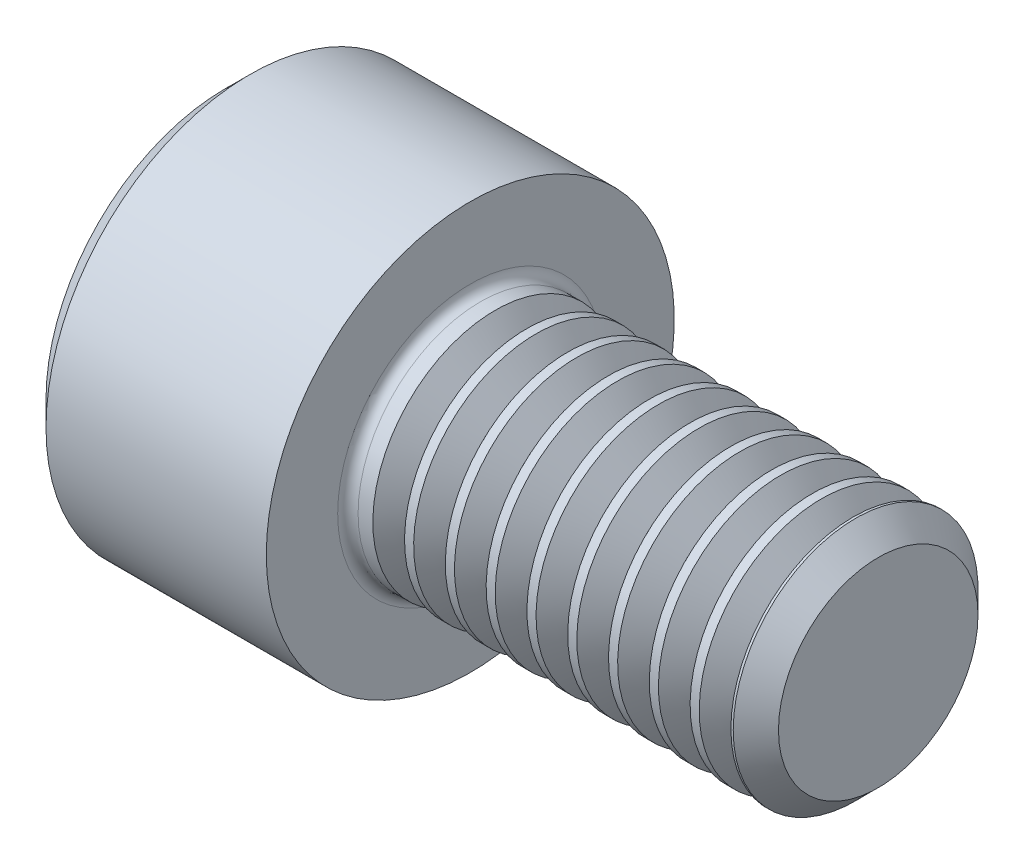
ISO-10303-21;
HEADER;
FILE_DESCRIPTION(('STEP AP214'),'2;1');
FILE_NAME('part.step','',(''),(''),'','','');
FILE_SCHEMA(('AUTOMOTIVE_DESIGN { 1 0 10303 214 1 1 1 1 }'));
ENDSEC;
DATA;
#1=APPLICATION_CONTEXT('core data for automotive mechanical design processes');
#2=APPLICATION_PROTOCOL_DEFINITION('international standard','automotive_design',2000,#1);
#3=PRODUCT_CONTEXT('',#1,'mechanical');
#4=PRODUCT('Part','Part','',(#3));
#5=PRODUCT_RELATED_PRODUCT_CATEGORY('part','',(#4));
#6=PRODUCT_DEFINITION_FORMATION('','',#4);
#7=PRODUCT_DEFINITION_CONTEXT('part definition',#1,'design');
#8=PRODUCT_DEFINITION('design','',#6,#7);
#9=PRODUCT_DEFINITION_SHAPE('','',#8);
#10=(LENGTH_UNIT() NAMED_UNIT(*) SI_UNIT(.MILLI.,.METRE.));
#11=(NAMED_UNIT(*) PLANE_ANGLE_UNIT() SI_UNIT($,.RADIAN.));
#12=(NAMED_UNIT(*) SI_UNIT($,.STERADIAN.) SOLID_ANGLE_UNIT());
#13=UNCERTAINTY_MEASURE_WITH_UNIT(LENGTH_MEASURE(1.E-05),#10,'distance_accuracy_value','');
#14=(GEOMETRIC_REPRESENTATION_CONTEXT(3) GLOBAL_UNCERTAINTY_ASSIGNED_CONTEXT((#13)) GLOBAL_UNIT_ASSIGNED_CONTEXT((#10,
#11,#12)) REPRESENTATION_CONTEXT('',''));
#15=CARTESIAN_POINT('',(0.,0.,0.));
#16=DIRECTION('',(0.,0.,1.));
#17=DIRECTION('',(1.,0.,0.));
#18=AXIS2_PLACEMENT_3D('',#15,#16,#17);
#19=CARTESIAN_POINT('',(0.,0.,0.));
#20=DIRECTION('',(-1.,0.,0.));
#21=DIRECTION('',(0.,0.,1.));
#22=AXIS2_PLACEMENT_3D('',#19,#20,#21);
#23=PLANE('',#22);
#24=DIRECTION('',(0.,-0.499999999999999,0.866025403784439));
#25=VECTOR('',#24,1.);
#26=CARTESIAN_POINT('',(0.,2.93524876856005,0.));
#27=LINE('',#26,#25);
#28=CARTESIAN_POINT('',(0.,2.93524876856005,0.));
#29=VERTEX_POINT('',#28);
#30=CARTESIAN_POINT('',(0.,1.46762438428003,2.542));
#31=VERTEX_POINT('',#30);
#32=EDGE_CURVE('E711',#29,#31,#27,.T.);
#33=ORIENTED_EDGE('',*,*,#32,.T.);
#34=DIRECTION('',(0.,1.,0.));
#35=VECTOR('',#34,1.);
#36=CARTESIAN_POINT('',(0.,-1.46762438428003,2.542));
#37=LINE('',#36,#35);
#38=CARTESIAN_POINT('',(0.,-1.46762438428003,2.542));
#39=VERTEX_POINT('',#38);
#40=EDGE_CURVE('E131',#39,#31,#37,.T.);
#41=ORIENTED_EDGE('',*,*,#40,.F.);
#42=DIRECTION('',(0.,-0.500000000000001,-0.866025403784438));
#43=VECTOR('',#42,1.);
#44=CARTESIAN_POINT('',(0.,-1.46762438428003,2.542));
#45=LINE('',#44,#43);
#46=CARTESIAN_POINT('',(0.,-2.93524876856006,0.));
#47=VERTEX_POINT('',#46);
#48=EDGE_CURVE('E730',#39,#47,#45,.T.);
#49=ORIENTED_EDGE('',*,*,#48,.T.);
#50=DIRECTION('',(0.,0.499999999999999,-0.866025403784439));
#51=VECTOR('',#50,1.);
#52=CARTESIAN_POINT('',(0.,-2.93524876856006,0.));
#53=LINE('',#52,#51);
#54=CARTESIAN_POINT('',(0.,-1.46762438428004,-2.542));
#55=VERTEX_POINT('',#54);
#56=EDGE_CURVE('E733',#47,#55,#53,.T.);
#57=ORIENTED_EDGE('',*,*,#56,.T.);
#58=DIRECTION('',(0.,-1.,0.));
#59=VECTOR('',#58,1.);
#60=CARTESIAN_POINT('',(0.,1.46762438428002,-2.542));
#61=LINE('',#60,#59);
#62=CARTESIAN_POINT('',(0.,1.46762438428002,-2.542));
#63=VERTEX_POINT('',#62);
#64=EDGE_CURVE('E736',#63,#55,#61,.T.);
#65=ORIENTED_EDGE('',*,*,#64,.F.);
#66=DIRECTION('',(0.,-0.500000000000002,-0.866025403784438));
#67=VECTOR('',#66,1.);
#68=CARTESIAN_POINT('',(0.,2.93524876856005,0.));
#69=LINE('',#68,#67);
#70=EDGE_CURVE('E126',#29,#63,#69,.T.);
#71=ORIENTED_EDGE('',*,*,#70,.F.);
#72=EDGE_LOOP('',(#33,#41,#49,#57,#65,#71));
#73=FACE_BOUND('',#72,.T.);
#74=CARTESIAN_POINT('',(0.,0.,0.));
#75=DIRECTION('',(-1.,0.,0.));
#76=DIRECTION('',(0.,0.,1.));
#77=AXIS2_PLACEMENT_3D('',#74,#75,#76);
#78=CIRCLE('',#77,4.4);
#79=CARTESIAN_POINT('',(0.,0.,4.4));
#80=VERTEX_POINT('',#79);
#81=EDGE_CURVE('E142',#80,#80,#78,.T.);
#82=ORIENTED_EDGE('',*,*,#81,.T.);
#83=EDGE_LOOP('',(#82));
#84=FACE_BOUND('',#83,.T.);
#85=ADVANCED_FACE('F35',(#73,#84),#23,.T.);
#86=CARTESIAN_POINT('',(-31.75,0.,0.));
#87=DIRECTION('',(-1.,0.,0.));
#88=DIRECTION('',(0.,0.,1.));
#89=AXIS2_PLACEMENT_3D('',#86,#87,#88);
#90=CYLINDRICAL_SURFACE('',#89,3.);
#91=CARTESIAN_POINT('',(6.61173492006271,0.,0.));
#92=DIRECTION('',(-1.,0.,0.));
#93=DIRECTION('',(0.,-1.,0.));
#94=AXIS2_PLACEMENT_3D('',#91,#92,#93);
#95=CIRCLE('',#94,3.);
#96=CARTESIAN_POINT('',(6.61173492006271,-3.,0.));
#97=VERTEX_POINT('',#96);
#98=EDGE_CURVE('E706',#97,#97,#95,.T.);
#99=ORIENTED_EDGE('',*,*,#98,.T.);
#100=EDGE_LOOP('',(#99));
#101=FACE_BOUND('',#100,.T.);
#102=CARTESIAN_POINT('',(6.25,0.,0.));
#103=DIRECTION('',(1.,0.,0.));
#104=DIRECTION('',(0.,0.,-1.));
#105=AXIS2_PLACEMENT_3D('',#102,#103,#104);
#106=CIRCLE('',#105,3.);
#107=CARTESIAN_POINT('',(6.25,0.,-3.));
#108=VERTEX_POINT('',#107);
#109=EDGE_CURVE('E11',#108,#108,#106,.T.);
#110=ORIENTED_EDGE('',*,*,#109,.T.);
#111=EDGE_LOOP('',(#110));
#112=FACE_BOUND('',#111,.T.);
#113=ADVANCED_FACE('F176',(#101,#112),#90,.T.);
#114=CARTESIAN_POINT('',(6.,5.,0.));
#115=DIRECTION('',(1.,0.,0.));
#116=DIRECTION('',(0.,0.,-1.));
#117=AXIS2_PLACEMENT_3D('',#114,#115,#116);
#118=PLANE('',#117);
#119=CARTESIAN_POINT('',(6.,0.,0.));
#120=DIRECTION('',(1.,0.,0.));
#121=DIRECTION('',(0.,0.,-1.));
#122=AXIS2_PLACEMENT_3D('',#119,#120,#121);
#123=CIRCLE('',#122,3.25);
#124=CARTESIAN_POINT('',(6.,0.,-3.25));
#125=VERTEX_POINT('',#124);
#126=EDGE_CURVE('E43',#125,#125,#123,.F.);
#127=ORIENTED_EDGE('',*,*,#126,.T.);
#128=EDGE_LOOP('',(#127));
#129=FACE_BOUND('',#128,.T.);
#130=CARTESIAN_POINT('',(6.00000000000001,0.,0.));
#131=DIRECTION('',(-1.,0.,0.));
#132=DIRECTION('',(0.,0.,1.));
#133=AXIS2_PLACEMENT_3D('',#130,#131,#132);
#134=CIRCLE('',#133,5.);
#135=CARTESIAN_POINT('',(6.00000000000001,0.,5.));
#136=VERTEX_POINT('',#135);
#137=EDGE_CURVE('E149',#136,#136,#134,.T.);
#138=ORIENTED_EDGE('',*,*,#137,.F.);
#139=EDGE_LOOP('',(#138));
#140=FACE_BOUND('',#139,.T.);
#141=ADVANCED_FACE('F160',(#129,#140),#118,.T.);
#142=CARTESIAN_POINT('',(-31.75,0.,0.));
#143=DIRECTION('',(-1.,0.,0.));
#144=DIRECTION('',(0.,0.,1.));
#145=AXIS2_PLACEMENT_3D('',#142,#143,#144);
#146=CYLINDRICAL_SURFACE('',#145,5.);
#147=ORIENTED_EDGE('',*,*,#137,.T.);
#148=EDGE_LOOP('',(#147));
#149=FACE_BOUND('',#148,.T.);
#150=CARTESIAN_POINT('',(0.600000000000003,0.,0.));
#151=DIRECTION('',(-1.,0.,0.));
#152=DIRECTION('',(0.,0.,1.));
#153=AXIS2_PLACEMENT_3D('',#150,#151,#152);
#154=CIRCLE('',#153,5.);
#155=CARTESIAN_POINT('',(0.600000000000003,0.,5.));
#156=VERTEX_POINT('',#155);
#157=EDGE_CURVE('E146',#156,#156,#154,.T.);
#158=ORIENTED_EDGE('',*,*,#157,.F.);
#159=EDGE_LOOP('',(#158));
#160=FACE_BOUND('',#159,.T.);
#161=ADVANCED_FACE('F171',(#149,#160),#146,.T.);
#162=CARTESIAN_POINT('',(0.,0.,0.));
#163=DIRECTION('',(1.,0.,0.));
#164=DIRECTION('',(0.,0.,-1.));
#165=AXIS2_PLACEMENT_3D('',#162,#163,#164);
#166=CONICAL_SURFACE('',#165,4.4,0.785398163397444);
#167=ORIENTED_EDGE('',*,*,#157,.T.);
#168=EDGE_LOOP('',(#167));
#169=FACE_BOUND('',#168,.T.);
#170=ORIENTED_EDGE('',*,*,#81,.F.);
#171=EDGE_LOOP('',(#170));
#172=FACE_BOUND('',#171,.T.);
#173=ADVANCED_FACE('F164',(#169,#172),#166,.T.);
#174=CARTESIAN_POINT('',(6.25,0.,0.));
#175=DIRECTION('',(1.,0.,0.));
#176=DIRECTION('',(0.,0.,-1.));
#177=AXIS2_PLACEMENT_3D('',#174,#175,#176);
#178=TOROIDAL_SURFACE('',#177,3.25,0.25);
#179=ORIENTED_EDGE('',*,*,#109,.F.);
#180=EDGE_LOOP('',(#179));
#181=FACE_BOUND('',#180,.T.);
#182=ORIENTED_EDGE('',*,*,#126,.F.);
#183=EDGE_LOOP('',(#182));
#184=FACE_BOUND('',#183,.T.);
#185=ADVANCED_FACE('F37',(#181,#184),#178,.F.);
#186=CARTESIAN_POINT('',(3.,2.93524876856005,0.));
#187=DIRECTION('',(0.,-0.866025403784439,-0.499999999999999));
#188=DIRECTION('',(0.,0.499999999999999,-0.866025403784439));
#189=AXIS2_PLACEMENT_3D('',#186,#187,#188);
#190=PLANE('',#189);
#191=ORIENTED_EDGE('',*,*,#32,.F.);
#192=DIRECTION('',(-1.,0.,0.));
#193=VECTOR('',#192,1.);
#194=CARTESIAN_POINT('',(3.,2.93524876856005,0.));
#195=LINE('',#194,#193);
#196=CARTESIAN_POINT('',(3.,2.93524876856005,0.));
#197=VERTEX_POINT('',#196);
#198=EDGE_CURVE('E727',#197,#29,#195,.T.);
#199=ORIENTED_EDGE('',*,*,#198,.F.);
#200=DIRECTION('',(0.,-0.499999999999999,0.866025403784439));
#201=VECTOR('',#200,1.);
#202=CARTESIAN_POINT('',(3.,2.93524876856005,0.));
#203=LINE('',#202,#201);
#204=CARTESIAN_POINT('',(3.,2.20143657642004,1.271));
#205=VERTEX_POINT('',#204);
#206=EDGE_CURVE('E118',#197,#205,#203,.T.);
#207=ORIENTED_EDGE('',*,*,#206,.T.);
#208=CARTESIAN_POINT('',(3.,1.46762438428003,2.542));
#209=VERTEX_POINT('',#208);
#210=EDGE_CURVE('E109',#205,#209,#203,.T.);
#211=ORIENTED_EDGE('',*,*,#210,.T.);
#212=DIRECTION('',(-1.,0.,0.));
#213=VECTOR('',#212,1.);
#214=CARTESIAN_POINT('',(3.,1.46762438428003,2.542));
#215=LINE('',#214,#213);
#216=EDGE_CURVE('E123',#209,#31,#215,.T.);
#217=ORIENTED_EDGE('',*,*,#216,.T.);
#218=EDGE_LOOP('',(#191,#199,#207,#211,#217));
#219=FACE_BOUND('',#218,.T.);
#220=ADVANCED_FACE('F122',(#219),#190,.T.);
#221=CARTESIAN_POINT('',(3.,-1.46762438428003,2.542));
#222=DIRECTION('',(0.,0.,1.));
#223=DIRECTION('',(0.,-1.,0.));
#224=AXIS2_PLACEMENT_3D('',#221,#222,#223);
#225=PLANE('',#224);
#226=ORIENTED_EDGE('',*,*,#40,.T.);
#227=ORIENTED_EDGE('',*,*,#216,.F.);
#228=DIRECTION('',(0.,1.,0.));
#229=VECTOR('',#228,1.);
#230=CARTESIAN_POINT('',(3.,-1.46762438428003,2.542));
#231=LINE('',#230,#229);
#232=CARTESIAN_POINT('',(3.,0.,2.542));
#233=VERTEX_POINT('',#232);
#234=EDGE_CURVE('E106',#233,#209,#231,.T.);
#235=ORIENTED_EDGE('',*,*,#234,.F.);
#236=CARTESIAN_POINT('',(3.,-1.46762438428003,2.542));
#237=VERTEX_POINT('',#236);
#238=EDGE_CURVE('E117',#237,#233,#231,.T.);
#239=ORIENTED_EDGE('',*,*,#238,.F.);
#240=DIRECTION('',(-1.,0.,0.));
#241=VECTOR('',#240,1.);
#242=CARTESIAN_POINT('',(3.,-1.46762438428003,2.542));
#243=LINE('',#242,#241);
#244=EDGE_CURVE('E133',#237,#39,#243,.T.);
#245=ORIENTED_EDGE('',*,*,#244,.T.);
#246=EDGE_LOOP('',(#226,#227,#235,#239,#245));
#247=FACE_BOUND('',#246,.T.);
#248=ADVANCED_FACE('F128',(#247),#225,.F.);
#249=CARTESIAN_POINT('',(3.,-1.46762438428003,2.542));
#250=DIRECTION('',(0.,0.866025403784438,-0.500000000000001));
#251=DIRECTION('',(0.,0.500000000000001,0.866025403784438));
#252=AXIS2_PLACEMENT_3D('',#249,#250,#251);
#253=PLANE('',#252);
#254=ORIENTED_EDGE('',*,*,#48,.F.);
#255=ORIENTED_EDGE('',*,*,#244,.F.);
#256=DIRECTION('',(0.,-0.500000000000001,-0.866025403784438));
#257=VECTOR('',#256,1.);
#258=CARTESIAN_POINT('',(3.,-1.46762438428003,2.542));
#259=LINE('',#258,#257);
#260=CARTESIAN_POINT('',(3.,-2.20143657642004,1.271));
#261=VERTEX_POINT('',#260);
#262=EDGE_CURVE('E714',#237,#261,#259,.T.);
#263=ORIENTED_EDGE('',*,*,#262,.T.);
#264=CARTESIAN_POINT('',(3.,-2.93524876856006,0.));
#265=VERTEX_POINT('',#264);
#266=EDGE_CURVE('E713',#261,#265,#259,.T.);
#267=ORIENTED_EDGE('',*,*,#266,.T.);
#268=DIRECTION('',(-1.,0.,0.));
#269=VECTOR('',#268,1.);
#270=CARTESIAN_POINT('',(3.,-2.93524876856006,0.));
#271=LINE('',#270,#269);
#272=EDGE_CURVE('E138',#265,#47,#271,.T.);
#273=ORIENTED_EDGE('',*,*,#272,.T.);
#274=EDGE_LOOP('',(#254,#255,#263,#267,#273));
#275=FACE_BOUND('',#274,.T.);
#276=ADVANCED_FACE('F306',(#275),#253,.T.);
#277=CARTESIAN_POINT('',(3.,-2.93524876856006,0.));
#278=DIRECTION('',(0.,0.866025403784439,0.499999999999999));
#279=DIRECTION('',(0.,-0.499999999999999,0.866025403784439));
#280=AXIS2_PLACEMENT_3D('',#277,#278,#279);
#281=PLANE('',#280);
#282=ORIENTED_EDGE('',*,*,#56,.F.);
#283=ORIENTED_EDGE('',*,*,#272,.F.);
#284=DIRECTION('',(0.,0.499999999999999,-0.866025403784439));
#285=VECTOR('',#284,1.);
#286=CARTESIAN_POINT('',(3.,-2.93524876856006,0.));
#287=LINE('',#286,#285);
#288=CARTESIAN_POINT('',(3.,-2.20143657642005,-1.271));
#289=VERTEX_POINT('',#288);
#290=EDGE_CURVE('E718',#265,#289,#287,.T.);
#291=ORIENTED_EDGE('',*,*,#290,.T.);
#292=CARTESIAN_POINT('',(3.,-1.46762438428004,-2.542));
#293=VERTEX_POINT('',#292);
#294=EDGE_CURVE('E717',#289,#293,#287,.T.);
#295=ORIENTED_EDGE('',*,*,#294,.T.);
#296=DIRECTION('',(-1.,0.,0.));
#297=VECTOR('',#296,1.);
#298=CARTESIAN_POINT('',(3.,-1.46762438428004,-2.542));
#299=LINE('',#298,#297);
#300=EDGE_CURVE('E745',#293,#55,#299,.T.);
#301=ORIENTED_EDGE('',*,*,#300,.T.);
#302=EDGE_LOOP('',(#282,#283,#291,#295,#301));
#303=FACE_BOUND('',#302,.T.);
#304=ADVANCED_FACE('F302',(#303),#281,.T.);
#305=CARTESIAN_POINT('',(3.,1.46762438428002,-2.542));
#306=DIRECTION('',(0.,0.,-1.));
#307=DIRECTION('',(0.,1.,0.));
#308=AXIS2_PLACEMENT_3D('',#305,#306,#307);
#309=PLANE('',#308);
#310=ORIENTED_EDGE('',*,*,#64,.T.);
#311=ORIENTED_EDGE('',*,*,#300,.F.);
#312=DIRECTION('',(0.,-1.,0.));
#313=VECTOR('',#312,1.);
#314=CARTESIAN_POINT('',(3.,1.46762438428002,-2.542));
#315=LINE('',#314,#313);
#316=CARTESIAN_POINT('',(3.00000000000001,0.,-2.542));
#317=VERTEX_POINT('',#316);
#318=EDGE_CURVE('E721',#317,#293,#315,.T.);
#319=ORIENTED_EDGE('',*,*,#318,.F.);
#320=CARTESIAN_POINT('',(3.,1.46762438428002,-2.542));
#321=VERTEX_POINT('',#320);
#322=EDGE_CURVE('E50',#321,#317,#315,.T.);
#323=ORIENTED_EDGE('',*,*,#322,.F.);
#324=DIRECTION('',(-1.,0.,0.));
#325=VECTOR('',#324,1.);
#326=CARTESIAN_POINT('',(3.,1.46762438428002,-2.542));
#327=LINE('',#326,#325);
#328=EDGE_CURVE('E742',#321,#63,#327,.T.);
#329=ORIENTED_EDGE('',*,*,#328,.T.);
#330=EDGE_LOOP('',(#310,#311,#319,#323,#329));
#331=FACE_BOUND('',#330,.T.);
#332=ADVANCED_FACE('F298',(#331),#309,.F.);
#333=CARTESIAN_POINT('',(3.,2.93524876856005,0.));
#334=DIRECTION('',(0.,0.866025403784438,-0.500000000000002));
#335=DIRECTION('',(0.,0.500000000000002,0.866025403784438));
#336=AXIS2_PLACEMENT_3D('',#333,#334,#335);
#337=PLANE('',#336);
#338=ORIENTED_EDGE('',*,*,#70,.T.);
#339=ORIENTED_EDGE('',*,*,#328,.F.);
#340=DIRECTION('',(0.,-0.500000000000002,-0.866025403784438));
#341=VECTOR('',#340,1.);
#342=CARTESIAN_POINT('',(3.,2.93524876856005,0.));
#343=LINE('',#342,#341);
#344=CARTESIAN_POINT('',(3.,2.20143657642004,-1.271));
#345=VERTEX_POINT('',#344);
#346=EDGE_CURVE('E723',#345,#321,#343,.T.);
#347=ORIENTED_EDGE('',*,*,#346,.F.);
#348=EDGE_CURVE('E724',#197,#345,#343,.T.);
#349=ORIENTED_EDGE('',*,*,#348,.F.);
#350=ORIENTED_EDGE('',*,*,#198,.T.);
#351=EDGE_LOOP('',(#338,#339,#347,#349,#350));
#352=FACE_BOUND('',#351,.T.);
#353=ADVANCED_FACE('F293',(#352),#337,.F.);
#354=CARTESIAN_POINT('',(3.,2.93524876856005,0.));
#355=DIRECTION('',(1.,0.,0.));
#356=DIRECTION('',(0.,0.,-1.));
#357=AXIS2_PLACEMENT_3D('',#354,#355,#356);
#358=PLANE('',#357);
#359=ORIENTED_EDGE('',*,*,#318,.T.);
#360=ORIENTED_EDGE('',*,*,#294,.F.);
#361=CARTESIAN_POINT('',(3.00000000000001,0.,0.));
#362=DIRECTION('',(-1.,0.,0.));
#363=DIRECTION('',(0.,0.,1.));
#364=AXIS2_PLACEMENT_3D('',#361,#362,#363);
#365=CIRCLE('',#364,2.542);
#366=EDGE_CURVE('E760',#317,#289,#365,.T.);
#367=ORIENTED_EDGE('',*,*,#366,.F.);
#368=EDGE_LOOP('',(#359,#360,#367));
#369=FACE_BOUND('',#368,.T.);
#370=ADVANCED_FACE('F289',(#369),#358,.F.);
#371=ORIENTED_EDGE('',*,*,#290,.F.);
#372=ORIENTED_EDGE('',*,*,#266,.F.);
#373=EDGE_CURVE('E136',#289,#261,#365,.T.);
#374=ORIENTED_EDGE('',*,*,#373,.F.);
#375=EDGE_LOOP('',(#371,#372,#374));
#376=FACE_BOUND('',#375,.T.);
#377=ADVANCED_FACE('F292',(#376),#358,.F.);
#378=ORIENTED_EDGE('',*,*,#262,.F.);
#379=ORIENTED_EDGE('',*,*,#238,.T.);
#380=EDGE_CURVE('E132',#261,#233,#365,.T.);
#381=ORIENTED_EDGE('',*,*,#380,.F.);
#382=EDGE_LOOP('',(#378,#379,#381));
#383=FACE_BOUND('',#382,.T.);
#384=ADVANCED_FACE('F342',(#383),#358,.F.);
#385=ORIENTED_EDGE('',*,*,#234,.T.);
#386=ORIENTED_EDGE('',*,*,#210,.F.);
#387=EDGE_CURVE('E112',#233,#205,#365,.T.);
#388=ORIENTED_EDGE('',*,*,#387,.F.);
#389=EDGE_LOOP('',(#385,#386,#388));
#390=FACE_BOUND('',#389,.T.);
#391=ADVANCED_FACE('F108',(#390),#358,.F.);
#392=ORIENTED_EDGE('',*,*,#206,.F.);
#393=ORIENTED_EDGE('',*,*,#348,.T.);
#394=EDGE_CURVE('E143',#205,#345,#365,.T.);
#395=ORIENTED_EDGE('',*,*,#394,.F.);
#396=EDGE_LOOP('',(#392,#393,#395));
#397=FACE_BOUND('',#396,.T.);
#398=ADVANCED_FACE('F355',(#397),#358,.F.);
#399=ORIENTED_EDGE('',*,*,#346,.T.);
#400=ORIENTED_EDGE('',*,*,#322,.T.);
#401=EDGE_CURVE('E759',#345,#317,#365,.T.);
#402=ORIENTED_EDGE('',*,*,#401,.F.);
#403=EDGE_LOOP('',(#399,#400,#402));
#404=FACE_BOUND('',#403,.T.);
#405=ADVANCED_FACE('F295',(#404),#358,.F.);
#406=CARTESIAN_POINT('',(3.00000000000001,0.,0.));
#407=DIRECTION('',(-1.,0.,0.));
#408=DIRECTION('',(0.,0.,1.));
#409=AXIS2_PLACEMENT_3D('',#406,#407,#408);
#410=CONICAL_SURFACE('',#409,2.542,1.04719755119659);
#411=CARTESIAN_POINT('',(4.46762438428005,0.,0.));
#412=VERTEX_POINT('',#411);
#413=VERTEX_LOOP('',#412);
#414=FACE_BOUND('',#413,.T.);
#415=ORIENTED_EDGE('',*,*,#387,.T.);
#416=ORIENTED_EDGE('',*,*,#394,.T.);
#417=ORIENTED_EDGE('',*,*,#401,.T.);
#418=ORIENTED_EDGE('',*,*,#366,.T.);
#419=ORIENTED_EDGE('',*,*,#373,.T.);
#420=ORIENTED_EDGE('',*,*,#380,.T.);
#421=EDGE_LOOP('',(#415,#416,#417,#418,#419,#420));
#422=FACE_BOUND('',#421,.T.);
#423=ADVANCED_FACE('F188',(#414,#422),#410,.F.);
#424=CARTESIAN_POINT('',(7.38826507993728,0.,0.));
#425=DIRECTION('',(1.,0.,0.));
#426=DIRECTION('',(0.,1.,0.));
#427=AXIS2_PLACEMENT_3D('',#424,#425,#426);
#428=CONICAL_SURFACE('',#427,3.,0.959931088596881);
#429=CARTESIAN_POINT('',(7.,0.,0.));
#430=DIRECTION('',(-1.,0.,0.));
#431=DIRECTION('',(0.,-1.,0.));
#432=AXIS2_PLACEMENT_3D('',#429,#430,#431);
#433=CIRCLE('',#432,2.4455);
#434=CARTESIAN_POINT('',(7.,-2.4455,0.));
#435=VERTEX_POINT('',#434);
#436=EDGE_CURVE('E703',#435,#435,#433,.T.);
#437=ORIENTED_EDGE('',*,*,#436,.F.);
#438=EDGE_LOOP('',(#437));
#439=FACE_BOUND('',#438,.T.);
#440=CARTESIAN_POINT('',(7.38826507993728,0.,0.));
#441=DIRECTION('',(-1.,0.,0.));
#442=DIRECTION('',(0.,-1.,0.));
#443=AXIS2_PLACEMENT_3D('',#440,#441,#442);
#444=CIRCLE('',#443,3.);
#445=CARTESIAN_POINT('',(7.38826507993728,-3.,0.));
#446=VERTEX_POINT('',#445);
#447=EDGE_CURVE('E709',#446,#446,#444,.T.);
#448=ORIENTED_EDGE('',*,*,#447,.T.);
#449=EDGE_LOOP('',(#448));
#450=FACE_BOUND('',#449,.T.);
#451=ADVANCED_FACE('F284',(#439,#450),#428,.T.);
#452=CARTESIAN_POINT('',(7.,0.,0.));
#453=DIRECTION('',(-1.,0.,0.));
#454=DIRECTION('',(0.,-1.,0.));
#455=AXIS2_PLACEMENT_3D('',#452,#453,#454);
#456=CONICAL_SURFACE('',#455,2.4455,0.959931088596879);
#457=ORIENTED_EDGE('',*,*,#98,.F.);
#458=EDGE_LOOP('',(#457));
#459=FACE_BOUND('',#458,.T.);
#460=ORIENTED_EDGE('',*,*,#436,.T.);
#461=EDGE_LOOP('',(#460));
#462=FACE_BOUND('',#461,.T.);
#463=ADVANCED_FACE('F281',(#459,#462),#456,.T.);
#464=CARTESIAN_POINT('',(7.61173492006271,0.,0.));
#465=DIRECTION('',(-1.,0.,0.));
#466=DIRECTION('',(0.,-1.,0.));
#467=AXIS2_PLACEMENT_3D('',#464,#465,#466);
#468=CIRCLE('',#467,3.);
#469=CARTESIAN_POINT('',(7.61173492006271,-3.,0.));
#470=VERTEX_POINT('',#469);
#471=EDGE_CURVE('E697',#470,#470,#468,.T.);
#472=ORIENTED_EDGE('',*,*,#471,.T.);
#473=EDGE_LOOP('',(#472));
#474=FACE_BOUND('',#473,.T.);
#475=ORIENTED_EDGE('',*,*,#447,.F.);
#476=EDGE_LOOP('',(#475));
#477=FACE_BOUND('',#476,.T.);
#478=ADVANCED_FACE('F185',(#474,#477),#90,.T.);
#479=CARTESIAN_POINT('',(8.38826507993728,0.,0.));
#480=DIRECTION('',(1.,0.,0.));
#481=DIRECTION('',(0.,1.,0.));
#482=AXIS2_PLACEMENT_3D('',#479,#480,#481);
#483=CONICAL_SURFACE('',#482,3.,0.959931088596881);
#484=CARTESIAN_POINT('',(8.,0.,0.));
#485=DIRECTION('',(-1.,0.,0.));
#486=DIRECTION('',(0.,-1.,0.));
#487=AXIS2_PLACEMENT_3D('',#484,#485,#486);
#488=CIRCLE('',#487,2.4455);
#489=CARTESIAN_POINT('',(8.,-2.4455,0.));
#490=VERTEX_POINT('',#489);
#491=EDGE_CURVE('E694',#490,#490,#488,.T.);
#492=ORIENTED_EDGE('',*,*,#491,.F.);
#493=EDGE_LOOP('',(#492));
#494=FACE_BOUND('',#493,.T.);
#495=CARTESIAN_POINT('',(8.38826507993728,0.,0.));
#496=DIRECTION('',(-1.,0.,0.));
#497=DIRECTION('',(0.,-1.,0.));
#498=AXIS2_PLACEMENT_3D('',#495,#496,#497);
#499=CIRCLE('',#498,3.);
#500=CARTESIAN_POINT('',(8.38826507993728,-3.,0.));
#501=VERTEX_POINT('',#500);
#502=EDGE_CURVE('E700',#501,#501,#499,.T.);
#503=ORIENTED_EDGE('',*,*,#502,.T.);
#504=EDGE_LOOP('',(#503));
#505=FACE_BOUND('',#504,.T.);
#506=ADVANCED_FACE('F276',(#494,#505),#483,.T.);
#507=CARTESIAN_POINT('',(8.,0.,0.));
#508=DIRECTION('',(-1.,0.,0.));
#509=DIRECTION('',(0.,-1.,0.));
#510=AXIS2_PLACEMENT_3D('',#507,#508,#509);
#511=CONICAL_SURFACE('',#510,2.4455,0.959931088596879);
#512=ORIENTED_EDGE('',*,*,#471,.F.);
#513=EDGE_LOOP('',(#512));
#514=FACE_BOUND('',#513,.T.);
#515=ORIENTED_EDGE('',*,*,#491,.T.);
#516=EDGE_LOOP('',(#515));
#517=FACE_BOUND('',#516,.T.);
#518=ADVANCED_FACE('F273',(#514,#517),#511,.T.);
#519=CARTESIAN_POINT('',(8.61173492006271,0.,0.));
#520=DIRECTION('',(-1.,0.,0.));
#521=DIRECTION('',(0.,-1.,0.));
#522=AXIS2_PLACEMENT_3D('',#519,#520,#521);
#523=CIRCLE('',#522,3.);
#524=CARTESIAN_POINT('',(8.61173492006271,-3.,0.));
#525=VERTEX_POINT('',#524);
#526=EDGE_CURVE('E688',#525,#525,#523,.T.);
#527=ORIENTED_EDGE('',*,*,#526,.T.);
#528=EDGE_LOOP('',(#527));
#529=FACE_BOUND('',#528,.T.);
#530=ORIENTED_EDGE('',*,*,#502,.F.);
#531=EDGE_LOOP('',(#530));
#532=FACE_BOUND('',#531,.T.);
#533=ADVANCED_FACE('F271',(#529,#532),#90,.T.);
#534=CARTESIAN_POINT('',(9.38826507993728,0.,0.));
#535=DIRECTION('',(1.,0.,0.));
#536=DIRECTION('',(0.,1.,0.));
#537=AXIS2_PLACEMENT_3D('',#534,#535,#536);
#538=CONICAL_SURFACE('',#537,3.,0.959931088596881);
#539=CARTESIAN_POINT('',(9.,0.,0.));
#540=DIRECTION('',(-1.,0.,0.));
#541=DIRECTION('',(0.,-1.,0.));
#542=AXIS2_PLACEMENT_3D('',#539,#540,#541);
#543=CIRCLE('',#542,2.4455);
#544=CARTESIAN_POINT('',(9.,-2.4455,0.));
#545=VERTEX_POINT('',#544);
#546=EDGE_CURVE('E685',#545,#545,#543,.T.);
#547=ORIENTED_EDGE('',*,*,#546,.F.);
#548=EDGE_LOOP('',(#547));
#549=FACE_BOUND('',#548,.T.);
#550=CARTESIAN_POINT('',(9.38826507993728,0.,0.));
#551=DIRECTION('',(-1.,0.,0.));
#552=DIRECTION('',(0.,-1.,0.));
#553=AXIS2_PLACEMENT_3D('',#550,#551,#552);
#554=CIRCLE('',#553,3.);
#555=CARTESIAN_POINT('',(9.38826507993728,-3.,0.));
#556=VERTEX_POINT('',#555);
#557=EDGE_CURVE('E691',#556,#556,#554,.T.);
#558=ORIENTED_EDGE('',*,*,#557,.T.);
#559=EDGE_LOOP('',(#558));
#560=FACE_BOUND('',#559,.T.);
#561=ADVANCED_FACE('F267',(#549,#560),#538,.T.);
#562=CARTESIAN_POINT('',(9.,0.,0.));
#563=DIRECTION('',(-1.,0.,0.));
#564=DIRECTION('',(0.,-1.,0.));
#565=AXIS2_PLACEMENT_3D('',#562,#563,#564);
#566=CONICAL_SURFACE('',#565,2.4455,0.959931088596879);
#567=ORIENTED_EDGE('',*,*,#526,.F.);
#568=EDGE_LOOP('',(#567));
#569=FACE_BOUND('',#568,.T.);
#570=ORIENTED_EDGE('',*,*,#546,.T.);
#571=EDGE_LOOP('',(#570));
#572=FACE_BOUND('',#571,.T.);
#573=ADVANCED_FACE('F264',(#569,#572),#566,.T.);
#574=CARTESIAN_POINT('',(9.61173492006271,0.,0.));
#575=DIRECTION('',(-1.,0.,0.));
#576=DIRECTION('',(0.,-1.,0.));
#577=AXIS2_PLACEMENT_3D('',#574,#575,#576);
#578=CIRCLE('',#577,3.);
#579=CARTESIAN_POINT('',(9.61173492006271,-3.,0.));
#580=VERTEX_POINT('',#579);
#581=EDGE_CURVE('E679',#580,#580,#578,.T.);
#582=ORIENTED_EDGE('',*,*,#581,.T.);
#583=EDGE_LOOP('',(#582));
#584=FACE_BOUND('',#583,.T.);
#585=ORIENTED_EDGE('',*,*,#557,.F.);
#586=EDGE_LOOP('',(#585));
#587=FACE_BOUND('',#586,.T.);
#588=ADVANCED_FACE('F262',(#584,#587),#90,.T.);
#589=CARTESIAN_POINT('',(10.3882650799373,0.,0.));
#590=DIRECTION('',(1.,0.,0.));
#591=DIRECTION('',(0.,1.,0.));
#592=AXIS2_PLACEMENT_3D('',#589,#590,#591);
#593=CONICAL_SURFACE('',#592,3.,0.959931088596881);
#594=CARTESIAN_POINT('',(10.,0.,0.));
#595=DIRECTION('',(-1.,0.,0.));
#596=DIRECTION('',(0.,-1.,0.));
#597=AXIS2_PLACEMENT_3D('',#594,#595,#596);
#598=CIRCLE('',#597,2.4455);
#599=CARTESIAN_POINT('',(10.,-2.4455,0.));
#600=VERTEX_POINT('',#599);
#601=EDGE_CURVE('E676',#600,#600,#598,.T.);
#602=ORIENTED_EDGE('',*,*,#601,.F.);
#603=EDGE_LOOP('',(#602));
#604=FACE_BOUND('',#603,.T.);
#605=CARTESIAN_POINT('',(10.3882650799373,0.,0.));
#606=DIRECTION('',(-1.,0.,0.));
#607=DIRECTION('',(0.,-1.,0.));
#608=AXIS2_PLACEMENT_3D('',#605,#606,#607);
#609=CIRCLE('',#608,3.);
#610=CARTESIAN_POINT('',(10.3882650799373,-3.,0.));
#611=VERTEX_POINT('',#610);
#612=EDGE_CURVE('E682',#611,#611,#609,.T.);
#613=ORIENTED_EDGE('',*,*,#612,.T.);
#614=EDGE_LOOP('',(#613));
#615=FACE_BOUND('',#614,.T.);
#616=ADVANCED_FACE('F258',(#604,#615),#593,.T.);
#617=CARTESIAN_POINT('',(10.,0.,0.));
#618=DIRECTION('',(-1.,0.,0.));
#619=DIRECTION('',(0.,-1.,0.));
#620=AXIS2_PLACEMENT_3D('',#617,#618,#619);
#621=CONICAL_SURFACE('',#620,2.4455,0.959931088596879);
#622=ORIENTED_EDGE('',*,*,#581,.F.);
#623=EDGE_LOOP('',(#622));
#624=FACE_BOUND('',#623,.T.);
#625=ORIENTED_EDGE('',*,*,#601,.T.);
#626=EDGE_LOOP('',(#625));
#627=FACE_BOUND('',#626,.T.);
#628=ADVANCED_FACE('F255',(#624,#627),#621,.T.);
#629=CARTESIAN_POINT('',(10.6117349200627,0.,0.));
#630=DIRECTION('',(-1.,0.,0.));
#631=DIRECTION('',(0.,-1.,0.));
#632=AXIS2_PLACEMENT_3D('',#629,#630,#631);
#633=CIRCLE('',#632,3.);
#634=CARTESIAN_POINT('',(10.6117349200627,-3.,0.));
#635=VERTEX_POINT('',#634);
#636=EDGE_CURVE('E670',#635,#635,#633,.T.);
#637=ORIENTED_EDGE('',*,*,#636,.T.);
#638=EDGE_LOOP('',(#637));
#639=FACE_BOUND('',#638,.T.);
#640=ORIENTED_EDGE('',*,*,#612,.F.);
#641=EDGE_LOOP('',(#640));
#642=FACE_BOUND('',#641,.T.);
#643=ADVANCED_FACE('F253',(#639,#642),#90,.T.);
#644=CARTESIAN_POINT('',(11.3882650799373,0.,0.));
#645=DIRECTION('',(1.,0.,0.));
#646=DIRECTION('',(0.,1.,0.));
#647=AXIS2_PLACEMENT_3D('',#644,#645,#646);
#648=CONICAL_SURFACE('',#647,3.,0.959931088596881);
#649=CARTESIAN_POINT('',(11.,0.,0.));
#650=DIRECTION('',(-1.,0.,0.));
#651=DIRECTION('',(0.,-1.,0.));
#652=AXIS2_PLACEMENT_3D('',#649,#650,#651);
#653=CIRCLE('',#652,2.4455);
#654=CARTESIAN_POINT('',(11.,-2.4455,0.));
#655=VERTEX_POINT('',#654);
#656=EDGE_CURVE('E667',#655,#655,#653,.T.);
#657=ORIENTED_EDGE('',*,*,#656,.F.);
#658=EDGE_LOOP('',(#657));
#659=FACE_BOUND('',#658,.T.);
#660=CARTESIAN_POINT('',(11.3882650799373,0.,0.));
#661=DIRECTION('',(-1.,0.,0.));
#662=DIRECTION('',(0.,-1.,0.));
#663=AXIS2_PLACEMENT_3D('',#660,#661,#662);
#664=CIRCLE('',#663,3.);
#665=CARTESIAN_POINT('',(11.3882650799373,-3.,0.));
#666=VERTEX_POINT('',#665);
#667=EDGE_CURVE('E673',#666,#666,#664,.T.);
#668=ORIENTED_EDGE('',*,*,#667,.T.);
#669=EDGE_LOOP('',(#668));
#670=FACE_BOUND('',#669,.T.);
#671=ADVANCED_FACE('F249',(#659,#670),#648,.T.);
#672=CARTESIAN_POINT('',(11.,0.,0.));
#673=DIRECTION('',(-1.,0.,0.));
#674=DIRECTION('',(0.,-1.,0.));
#675=AXIS2_PLACEMENT_3D('',#672,#673,#674);
#676=CONICAL_SURFACE('',#675,2.4455,0.959931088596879);
#677=ORIENTED_EDGE('',*,*,#636,.F.);
#678=EDGE_LOOP('',(#677));
#679=FACE_BOUND('',#678,.T.);
#680=ORIENTED_EDGE('',*,*,#656,.T.);
#681=EDGE_LOOP('',(#680));
#682=FACE_BOUND('',#681,.T.);
#683=ADVANCED_FACE('F246',(#679,#682),#676,.T.);
#684=CARTESIAN_POINT('',(11.6117349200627,0.,0.));
#685=DIRECTION('',(-1.,0.,0.));
#686=DIRECTION('',(0.,-1.,0.));
#687=AXIS2_PLACEMENT_3D('',#684,#685,#686);
#688=CIRCLE('',#687,3.);
#689=CARTESIAN_POINT('',(11.6117349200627,-3.,0.));
#690=VERTEX_POINT('',#689);
#691=EDGE_CURVE('E661',#690,#690,#688,.T.);
#692=ORIENTED_EDGE('',*,*,#691,.T.);
#693=EDGE_LOOP('',(#692));
#694=FACE_BOUND('',#693,.T.);
#695=ORIENTED_EDGE('',*,*,#667,.F.);
#696=EDGE_LOOP('',(#695));
#697=FACE_BOUND('',#696,.T.);
#698=ADVANCED_FACE('F244',(#694,#697),#90,.T.);
#699=CARTESIAN_POINT('',(12.3882650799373,0.,0.));
#700=DIRECTION('',(1.,0.,0.));
#701=DIRECTION('',(0.,1.,0.));
#702=AXIS2_PLACEMENT_3D('',#699,#700,#701);
#703=CONICAL_SURFACE('',#702,3.,0.959931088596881);
#704=CARTESIAN_POINT('',(12.,0.,0.));
#705=DIRECTION('',(-1.,0.,0.));
#706=DIRECTION('',(0.,-1.,0.));
#707=AXIS2_PLACEMENT_3D('',#704,#705,#706);
#708=CIRCLE('',#707,2.4455);
#709=CARTESIAN_POINT('',(12.,-2.4455,0.));
#710=VERTEX_POINT('',#709);
#711=EDGE_CURVE('E658',#710,#710,#708,.T.);
#712=ORIENTED_EDGE('',*,*,#711,.F.);
#713=EDGE_LOOP('',(#712));
#714=FACE_BOUND('',#713,.T.);
#715=CARTESIAN_POINT('',(12.3882650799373,0.,0.));
#716=DIRECTION('',(-1.,0.,0.));
#717=DIRECTION('',(0.,-1.,0.));
#718=AXIS2_PLACEMENT_3D('',#715,#716,#717);
#719=CIRCLE('',#718,3.);
#720=CARTESIAN_POINT('',(12.3882650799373,-3.,0.));
#721=VERTEX_POINT('',#720);
#722=EDGE_CURVE('E664',#721,#721,#719,.T.);
#723=ORIENTED_EDGE('',*,*,#722,.T.);
#724=EDGE_LOOP('',(#723));
#725=FACE_BOUND('',#724,.T.);
#726=ADVANCED_FACE('F240',(#714,#725),#703,.T.);
#727=CARTESIAN_POINT('',(12.,0.,0.));
#728=DIRECTION('',(-1.,0.,0.));
#729=DIRECTION('',(0.,-1.,0.));
#730=AXIS2_PLACEMENT_3D('',#727,#728,#729);
#731=CONICAL_SURFACE('',#730,2.4455,0.959931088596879);
#732=ORIENTED_EDGE('',*,*,#691,.F.);
#733=EDGE_LOOP('',(#732));
#734=FACE_BOUND('',#733,.T.);
#735=ORIENTED_EDGE('',*,*,#711,.T.);
#736=EDGE_LOOP('',(#735));
#737=FACE_BOUND('',#736,.T.);
#738=ADVANCED_FACE('F237',(#734,#737),#731,.T.);
#739=CARTESIAN_POINT('',(12.6117349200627,0.,0.));
#740=DIRECTION('',(-1.,0.,0.));
#741=DIRECTION('',(0.,-1.,0.));
#742=AXIS2_PLACEMENT_3D('',#739,#740,#741);
#743=CIRCLE('',#742,3.);
#744=CARTESIAN_POINT('',(12.6117349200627,-3.,0.));
#745=VERTEX_POINT('',#744);
#746=EDGE_CURVE('E652',#745,#745,#743,.T.);
#747=ORIENTED_EDGE('',*,*,#746,.T.);
#748=EDGE_LOOP('',(#747));
#749=FACE_BOUND('',#748,.T.);
#750=ORIENTED_EDGE('',*,*,#722,.F.);
#751=EDGE_LOOP('',(#750));
#752=FACE_BOUND('',#751,.T.);
#753=ADVANCED_FACE('F235',(#749,#752),#90,.T.);
#754=CARTESIAN_POINT('',(13.3882650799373,0.,0.));
#755=DIRECTION('',(1.,0.,0.));
#756=DIRECTION('',(0.,1.,0.));
#757=AXIS2_PLACEMENT_3D('',#754,#755,#756);
#758=CONICAL_SURFACE('',#757,3.,0.959931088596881);
#759=CARTESIAN_POINT('',(13.,0.,0.));
#760=DIRECTION('',(-1.,0.,0.));
#761=DIRECTION('',(0.,-1.,0.));
#762=AXIS2_PLACEMENT_3D('',#759,#760,#761);
#763=CIRCLE('',#762,2.4455);
#764=CARTESIAN_POINT('',(13.,-2.4455,0.));
#765=VERTEX_POINT('',#764);
#766=EDGE_CURVE('E649',#765,#765,#763,.T.);
#767=ORIENTED_EDGE('',*,*,#766,.F.);
#768=EDGE_LOOP('',(#767));
#769=FACE_BOUND('',#768,.T.);
#770=CARTESIAN_POINT('',(13.3882650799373,0.,0.));
#771=DIRECTION('',(-1.,0.,0.));
#772=DIRECTION('',(0.,-1.,0.));
#773=AXIS2_PLACEMENT_3D('',#770,#771,#772);
#774=CIRCLE('',#773,3.);
#775=CARTESIAN_POINT('',(13.3882650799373,-3.,0.));
#776=VERTEX_POINT('',#775);
#777=EDGE_CURVE('E655',#776,#776,#774,.T.);
#778=ORIENTED_EDGE('',*,*,#777,.T.);
#779=EDGE_LOOP('',(#778));
#780=FACE_BOUND('',#779,.T.);
#781=ADVANCED_FACE('F231',(#769,#780),#758,.T.);
#782=CARTESIAN_POINT('',(13.,0.,0.));
#783=DIRECTION('',(-1.,0.,0.));
#784=DIRECTION('',(0.,-1.,0.));
#785=AXIS2_PLACEMENT_3D('',#782,#783,#784);
#786=CONICAL_SURFACE('',#785,2.4455,0.959931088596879);
#787=ORIENTED_EDGE('',*,*,#746,.F.);
#788=EDGE_LOOP('',(#787));
#789=FACE_BOUND('',#788,.T.);
#790=ORIENTED_EDGE('',*,*,#766,.T.);
#791=EDGE_LOOP('',(#790));
#792=FACE_BOUND('',#791,.T.);
#793=ADVANCED_FACE('F228',(#789,#792),#786,.T.);
#794=CARTESIAN_POINT('',(13.6117349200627,0.,0.));
#795=DIRECTION('',(-1.,0.,0.));
#796=DIRECTION('',(0.,-1.,0.));
#797=AXIS2_PLACEMENT_3D('',#794,#795,#796);
#798=CIRCLE('',#797,3.);
#799=CARTESIAN_POINT('',(13.6117349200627,-3.,0.));
#800=VERTEX_POINT('',#799);
#801=EDGE_CURVE('E637',#800,#800,#798,.T.);
#802=ORIENTED_EDGE('',*,*,#801,.T.);
#803=EDGE_LOOP('',(#802));
#804=FACE_BOUND('',#803,.T.);
#805=ORIENTED_EDGE('',*,*,#777,.F.);
#806=EDGE_LOOP('',(#805));
#807=FACE_BOUND('',#806,.T.);
#808=ADVANCED_FACE('F226',(#804,#807),#90,.T.);
#809=CARTESIAN_POINT('',(14.3882650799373,0.,0.));
#810=DIRECTION('',(1.,0.,0.));
#811=DIRECTION('',(0.,1.,0.));
#812=AXIS2_PLACEMENT_3D('',#809,#810,#811);
#813=CONICAL_SURFACE('',#812,3.,0.959931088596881);
#814=CARTESIAN_POINT('',(14.,0.,0.));
#815=DIRECTION('',(-1.,0.,0.));
#816=DIRECTION('',(0.,-1.,0.));
#817=AXIS2_PLACEMENT_3D('',#814,#815,#816);
#818=CIRCLE('',#817,2.4455);
#819=CARTESIAN_POINT('',(14.,-2.4455,0.));
#820=VERTEX_POINT('',#819);
#821=EDGE_CURVE('E633',#820,#820,#818,.T.);
#822=ORIENTED_EDGE('',*,*,#821,.F.);
#823=EDGE_LOOP('',(#822));
#824=FACE_BOUND('',#823,.T.);
#825=CARTESIAN_POINT('',(14.3882650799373,0.,0.));
#826=DIRECTION('',(-1.,0.,0.));
#827=DIRECTION('',(0.,-1.,0.));
#828=AXIS2_PLACEMENT_3D('',#825,#826,#827);
#829=CIRCLE('',#828,3.);
#830=CARTESIAN_POINT('',(14.3882650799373,-3.,0.));
#831=VERTEX_POINT('',#830);
#832=EDGE_CURVE('E646',#831,#831,#829,.T.);
#833=ORIENTED_EDGE('',*,*,#832,.T.);
#834=EDGE_LOOP('',(#833));
#835=FACE_BOUND('',#834,.T.);
#836=ADVANCED_FACE('F222',(#824,#835),#813,.T.);
#837=CARTESIAN_POINT('',(14.,0.,0.));
#838=DIRECTION('',(-1.,0.,0.));
#839=DIRECTION('',(0.,-1.,0.));
#840=AXIS2_PLACEMENT_3D('',#837,#838,#839);
#841=CONICAL_SURFACE('',#840,2.4455,0.959931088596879);
#842=ORIENTED_EDGE('',*,*,#801,.F.);
#843=EDGE_LOOP('',(#842));
#844=FACE_BOUND('',#843,.T.);
#845=ORIENTED_EDGE('',*,*,#821,.T.);
#846=EDGE_LOOP('',(#845));
#847=FACE_BOUND('',#846,.T.);
#848=ADVANCED_FACE('F219',(#844,#847),#841,.T.);
#849=CARTESIAN_POINT('',(14.6117349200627,0.,0.));
#850=DIRECTION('',(-1.,0.,0.));
#851=DIRECTION('',(0.,-1.,0.));
#852=AXIS2_PLACEMENT_3D('',#849,#850,#851);
#853=CIRCLE('',#852,3.);
#854=CARTESIAN_POINT('',(14.6117349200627,-3.,0.));
#855=VERTEX_POINT('',#854);
#856=EDGE_CURVE('E634',#855,#855,#853,.T.);
#857=ORIENTED_EDGE('',*,*,#856,.T.);
#858=EDGE_LOOP('',(#857));
#859=FACE_BOUND('',#858,.T.);
#860=ORIENTED_EDGE('',*,*,#832,.F.);
#861=EDGE_LOOP('',(#860));
#862=FACE_BOUND('',#861,.T.);
#863=ADVANCED_FACE('F213',(#859,#862),#90,.T.);
#864=CARTESIAN_POINT('',(15.3882650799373,0.,0.));
#865=DIRECTION('',(1.,0.,0.));
#866=DIRECTION('',(0.,1.,0.));
#867=AXIS2_PLACEMENT_3D('',#864,#865,#866);
#868=CONICAL_SURFACE('',#867,3.,0.959931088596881);
#869=CARTESIAN_POINT('',(15.,0.,0.));
#870=DIRECTION('',(-1.,0.,0.));
#871=DIRECTION('',(0.,-1.,0.));
#872=AXIS2_PLACEMENT_3D('',#869,#870,#871);
#873=CIRCLE('',#872,2.4455);
#874=CARTESIAN_POINT('',(15.,-2.4455,0.));
#875=VERTEX_POINT('',#874);
#876=EDGE_CURVE('E640',#875,#875,#873,.T.);
#877=ORIENTED_EDGE('',*,*,#876,.F.);
#878=EDGE_LOOP('',(#877));
#879=FACE_BOUND('',#878,.T.);
#880=CARTESIAN_POINT('',(15.3882650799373,0.,0.));
#881=DIRECTION('',(-1.,0.,0.));
#882=DIRECTION('',(0.,-1.,0.));
#883=AXIS2_PLACEMENT_3D('',#880,#881,#882);
#884=CIRCLE('',#883,3.);
#885=CARTESIAN_POINT('',(15.3882650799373,-3.,0.));
#886=VERTEX_POINT('',#885);
#887=EDGE_CURVE('E630',#886,#886,#884,.T.);
#888=ORIENTED_EDGE('',*,*,#887,.T.);
#889=EDGE_LOOP('',(#888));
#890=FACE_BOUND('',#889,.T.);
#891=ADVANCED_FACE('F205',(#879,#890),#868,.T.);
#892=CARTESIAN_POINT('',(15.,0.,0.));
#893=DIRECTION('',(-1.,0.,0.));
#894=DIRECTION('',(0.,-1.,0.));
#895=AXIS2_PLACEMENT_3D('',#892,#893,#894);
#896=CONICAL_SURFACE('',#895,2.4455,0.959931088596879);
#897=ORIENTED_EDGE('',*,*,#856,.F.);
#898=EDGE_LOOP('',(#897));
#899=FACE_BOUND('',#898,.T.);
#900=ORIENTED_EDGE('',*,*,#876,.T.);
#901=EDGE_LOOP('',(#900));
#902=FACE_BOUND('',#901,.T.);
#903=ADVANCED_FACE('F200',(#899,#902),#896,.T.);
#904=CARTESIAN_POINT('',(16.,2.4455,0.));
#905=DIRECTION('',(1.,0.,0.));
#906=DIRECTION('',(0.,0.,-1.));
#907=AXIS2_PLACEMENT_3D('',#904,#905,#906);
#908=PLANE('',#907);
#909=CARTESIAN_POINT('',(16.,0.,0.));
#910=DIRECTION('',(-1.,0.,0.));
#911=DIRECTION('',(0.,0.,1.));
#912=AXIS2_PLACEMENT_3D('',#909,#910,#911);
#913=CIRCLE('',#912,2.4455);
#914=CARTESIAN_POINT('',(16.,0.,2.4455));
#915=VERTEX_POINT('',#914);
#916=EDGE_CURVE('E155',#915,#915,#913,.T.);
#917=ORIENTED_EDGE('',*,*,#916,.F.);
#918=EDGE_LOOP('',(#917));
#919=FACE_BOUND('',#918,.T.);
#920=ADVANCED_FACE('F197',(#919),#908,.T.);
#921=CARTESIAN_POINT('',(16.,0.,0.));
#922=DIRECTION('',(-1.,0.,0.));
#923=DIRECTION('',(0.,0.,1.));
#924=AXIS2_PLACEMENT_3D('',#921,#922,#923);
#925=CONICAL_SURFACE('',#924,2.4455,0.785398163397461);
#926=CARTESIAN_POINT('',(15.4455,0.,0.));
#927=DIRECTION('',(-1.,0.,0.));
#928=DIRECTION('',(0.,0.,1.));
#929=AXIS2_PLACEMENT_3D('',#926,#927,#928);
#930=CIRCLE('',#929,3.);
#931=CARTESIAN_POINT('',(15.4455,0.,3.));
#932=VERTEX_POINT('',#931);
#933=EDGE_CURVE('E152',#932,#932,#930,.T.);
#934=ORIENTED_EDGE('',*,*,#933,.F.);
#935=EDGE_LOOP('',(#934));
#936=FACE_BOUND('',#935,.T.);
#937=ORIENTED_EDGE('',*,*,#916,.T.);
#938=EDGE_LOOP('',(#937));
#939=FACE_BOUND('',#938,.T.);
#940=ADVANCED_FACE('F195',(#936,#939),#925,.T.);
#941=ORIENTED_EDGE('',*,*,#887,.F.);
#942=EDGE_LOOP('',(#941));
#943=FACE_BOUND('',#942,.T.);
#944=ORIENTED_EDGE('',*,*,#933,.T.);
#945=EDGE_LOOP('',(#944));
#946=FACE_BOUND('',#945,.T.);
#947=ADVANCED_FACE('F184',(#943,#946),#90,.T.);
#948=CLOSED_SHELL('',(#85,#113,#141,#161,#173,#185,#220,#248,#276,#304,#332,#353,#370,#377,#384,
#391,#398,#405,#423,#451,#463,#478,#506,#518,#533,#561,#573,#588,#616,#628,#643,#671,#683,#698,
#726,#738,#753,#781,#793,#808,#836,#848,#863,#891,#903,#920,#940,#947));
#949=MANIFOLD_SOLID_BREP('B2',#948);
#950=ADVANCED_BREP_SHAPE_REPRESENTATION('',(#18,#949),#14);
#951=SHAPE_DEFINITION_REPRESENTATION(#9,#950);
ENDSEC;
END-ISO-10303-21;
